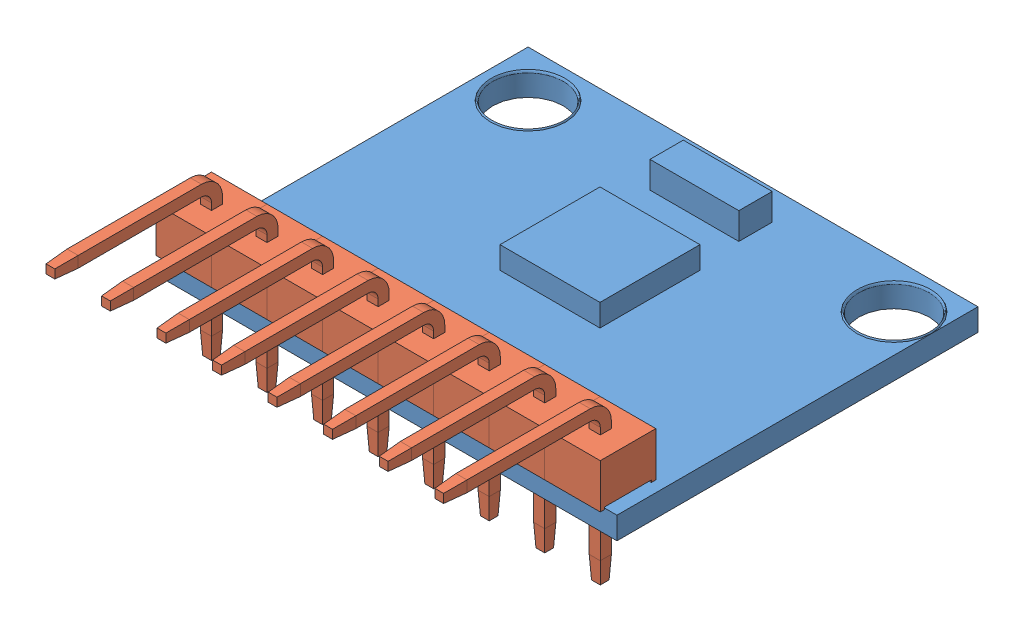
SolidWorks assembly GY521.SLDASM, configuration Predeterminado (file format 5000). Lengths in mm.
Overall size (20.52 65.96 22.5).
9 component instances, 2 part files, 3 mates.
Components (placement in the parent):
- Placa_GY521-1: Placa_GY521.SLDPRT [Predeterminado] at (0.1306 -0.272 0) size (20.27 65.96 16.25)
- PIN_90deg-1: PIN_90deg.SLDPRT [Predeterminado] at (-9.1926 0.728 6.9495) x (-1 0 0) z (0 0 -1) size (2.5 7.15 8.5)
- PIN_90deg-2: PIN_90deg.SLDPRT [Predeterminado] at (-6.6926 0.728 6.9495) x (-1 0 0) z (0 0 -1) size (2.5 7.15 8.5)
- PIN_90deg-3: PIN_90deg.SLDPRT [Predeterminado] at (-4.1926 0.728 6.9495) x (-1 0 0) z (0 0 -1) size (2.5 7.15 8.5)
- PIN_90deg-4: PIN_90deg.SLDPRT [Predeterminado] at (-1.6926 0.728 6.9495) x (-1 0 0) z (0 0 -1) size (2.5 7.15 8.5)
- PIN_90deg-5: PIN_90deg.SLDPRT [Predeterminado] at (0.8074 0.728 6.9495) x (-1 0 0) z (0 0 -1) size (2.5 7.15 8.5)
- PIN_90deg-6: PIN_90deg.SLDPRT [Predeterminado] at (3.3074 0.728 6.9495) x (-1 0 0) z (0 0 -1) size (2.5 7.15 8.5)
- PIN_90deg-7: PIN_90deg.SLDPRT [Predeterminado] at (5.8074 0.728 6.9495) x (-1 0 0) z (0 0 -1) size (2.5 7.15 8.5)
- PIN_90deg-8: PIN_90deg.SLDPRT [Predeterminado] at (8.3074 0.728 6.9495) x (-1 0 0) z (0 0 -1) size (2.5 7.15 8.5)
Mates (geometry in assembly coordinates):
- Coincidente1: coincident anti-aligned: plane of Placa_GY521-1 through (-9.3426 0.728 6.6995) normal (0 0 1); plane of PIN_90deg-1 through (-8.9426 -3.172 6.6995) normal (0 0 -1)
- Coincidente2: coincident anti-aligned: plane of Placa_GY521-1 through (-8.9426 0.728 7.0995) normal (-1 0 0); plane of PIN_90deg-1 through (-8.9426 -3.172 7.1995) normal (1 0 0)
- Coincidente3: coincident anti-aligned: plane of Placa_GY521-1 through (0.1306 0.728 0) normal (0 1 0); plane of PIN_90deg-1 through (-9.1926 0.728 6.9495) normal (0 -1 0)
